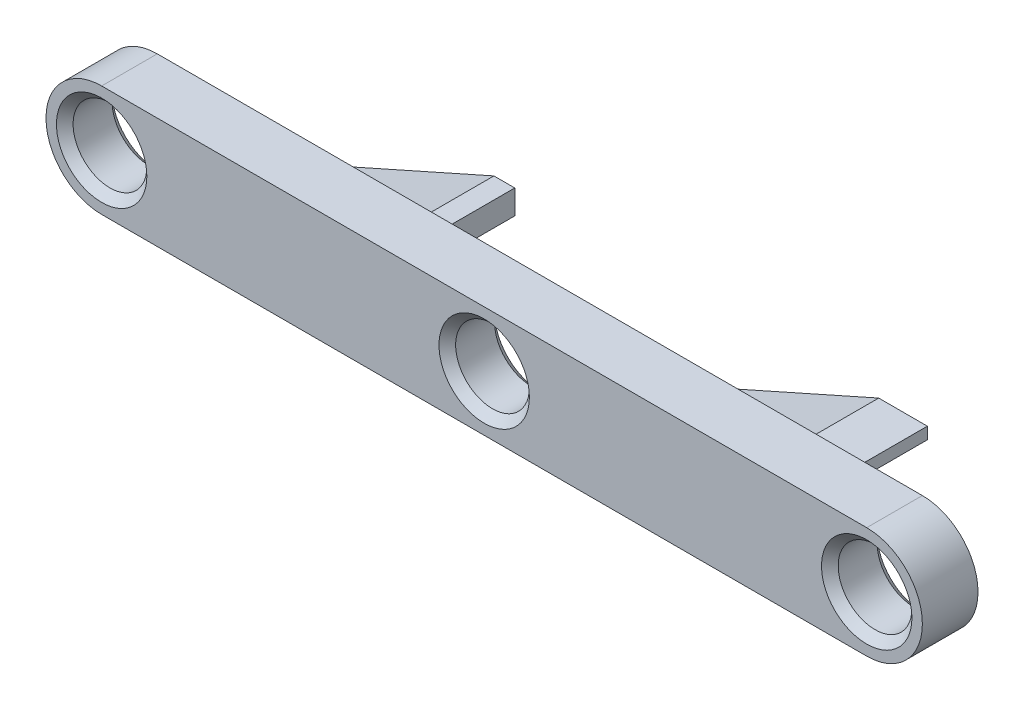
ISO-10303-21;
HEADER;
FILE_DESCRIPTION(('STEP AP214'),'2;1');
FILE_NAME('part.step','',(''),(''),'','','');
FILE_SCHEMA(('AUTOMOTIVE_DESIGN { 1 0 10303 214 1 1 1 1 }'));
ENDSEC;
DATA;
#1=APPLICATION_CONTEXT('core data for automotive mechanical design processes');
#2=APPLICATION_PROTOCOL_DEFINITION('international standard','automotive_design',2000,#1);
#3=PRODUCT_CONTEXT('',#1,'mechanical');
#4=PRODUCT('Part','Part','',(#3));
#5=PRODUCT_RELATED_PRODUCT_CATEGORY('part','',(#4));
#6=PRODUCT_DEFINITION_FORMATION('','',#4);
#7=PRODUCT_DEFINITION_CONTEXT('part definition',#1,'design');
#8=PRODUCT_DEFINITION('design','',#6,#7);
#9=PRODUCT_DEFINITION_SHAPE('','',#8);
#10=(LENGTH_UNIT() NAMED_UNIT(*) SI_UNIT(.MILLI.,.METRE.));
#11=(NAMED_UNIT(*) PLANE_ANGLE_UNIT() SI_UNIT($,.RADIAN.));
#12=(NAMED_UNIT(*) SI_UNIT($,.STERADIAN.) SOLID_ANGLE_UNIT());
#13=UNCERTAINTY_MEASURE_WITH_UNIT(LENGTH_MEASURE(1.E-05),#10,'distance_accuracy_value','');
#14=(GEOMETRIC_REPRESENTATION_CONTEXT(3) GLOBAL_UNCERTAINTY_ASSIGNED_CONTEXT((#13)) GLOBAL_UNIT_ASSIGNED_CONTEXT((#10,
#11,#12)) REPRESENTATION_CONTEXT('',''));
#15=CARTESIAN_POINT('',(0.,0.,0.));
#16=DIRECTION('',(0.,0.,1.));
#17=DIRECTION('',(1.,0.,0.));
#18=AXIS2_PLACEMENT_3D('',#15,#16,#17);
#19=CARTESIAN_POINT('',(-27.5,0.,0.));
#20=DIRECTION('',(0.,0.,1.));
#21=DIRECTION('',(1.,0.,0.));
#22=AXIS2_PLACEMENT_3D('',#19,#20,#21);
#23=PLANE('',#22);
#24=CARTESIAN_POINT('',(27.5,0.,0.));
#25=DIRECTION('',(0.,0.,1.));
#26=DIRECTION('',(1.,0.,0.));
#27=AXIS2_PLACEMENT_3D('',#24,#25,#26);
#28=CIRCLE('',#27,4.00000000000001);
#29=CARTESIAN_POINT('',(27.5,-4.00000000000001,0.));
#30=VERTEX_POINT('',#29);
#31=CARTESIAN_POINT('',(27.5,4.00000000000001,0.));
#32=VERTEX_POINT('',#31);
#33=EDGE_CURVE('E252',#30,#32,#28,.T.);
#34=ORIENTED_EDGE('',*,*,#33,.F.);
#35=DIRECTION('',(1.,0.,0.));
#36=VECTOR('',#35,1.);
#37=CARTESIAN_POINT('',(-27.5,-4.,0.));
#38=LINE('',#37,#36);
#39=CARTESIAN_POINT('',(-27.5,-4.,0.));
#40=VERTEX_POINT('',#39);
#41=EDGE_CURVE('E250',#40,#30,#38,.T.);
#42=ORIENTED_EDGE('',*,*,#41,.F.);
#43=CARTESIAN_POINT('',(-27.5,0.,0.));
#44=DIRECTION('',(0.,0.,1.));
#45=DIRECTION('',(1.,0.,0.));
#46=AXIS2_PLACEMENT_3D('',#43,#44,#45);
#47=CIRCLE('',#46,4.);
#48=CARTESIAN_POINT('',(-27.5,4.,0.));
#49=VERTEX_POINT('',#48);
#50=EDGE_CURVE('E236',#49,#40,#47,.T.);
#51=ORIENTED_EDGE('',*,*,#50,.F.);
#52=DIRECTION('',(-1.,0.,0.));
#53=VECTOR('',#52,1.);
#54=CARTESIAN_POINT('',(-27.5,4.,0.));
#55=LINE('',#54,#53);
#56=EDGE_CURVE('E241',#32,#49,#55,.T.);
#57=ORIENTED_EDGE('',*,*,#56,.F.);
#58=EDGE_LOOP('',(#34,#42,#51,#57));
#59=FACE_BOUND('',#58,.T.);
#60=DIRECTION('',(-1.,0.,0.));
#61=VECTOR('',#60,1.);
#62=CARTESIAN_POINT('',(8.,-3.8,0.));
#63=LINE('',#62,#61);
#64=CARTESIAN_POINT('',(8.,-3.8,0.));
#65=VERTEX_POINT('',#64);
#66=CARTESIAN_POINT('',(6.5,-3.8,0.));
#67=VERTEX_POINT('',#66);
#68=EDGE_CURVE('E212',#65,#67,#63,.T.);
#69=ORIENTED_EDGE('',*,*,#68,.F.);
#70=DIRECTION('',(-0.913545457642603,-0.406736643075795,0.));
#71=VECTOR('',#70,1.);
#72=CARTESIAN_POINT('',(23.160974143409,2.95010058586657,0.));
#73=LINE('',#72,#71);
#74=CARTESIAN_POINT('',(23.1609741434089,2.95010058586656,0.));
#75=VERTEX_POINT('',#74);
#76=EDGE_CURVE('E210',#75,#65,#73,.T.);
#77=ORIENTED_EDGE('',*,*,#76,.F.);
#78=DIRECTION('',(0.,-1.,0.));
#79=VECTOR('',#78,1.);
#80=CARTESIAN_POINT('',(23.160974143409,3.80000000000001,0.));
#81=LINE('',#80,#79);
#82=CARTESIAN_POINT('',(23.1609741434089,3.80000000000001,0.));
#83=VERTEX_POINT('',#82);
#84=EDGE_CURVE('E187',#83,#75,#81,.T.);
#85=ORIENTED_EDGE('',*,*,#84,.F.);
#86=DIRECTION('',(1.,0.,0.));
#87=VECTOR('',#86,1.);
#88=CARTESIAN_POINT('',(19.660974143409,3.80000000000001,0.));
#89=LINE('',#88,#87);
#90=CARTESIAN_POINT('',(19.660974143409,3.80000000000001,0.));
#91=VERTEX_POINT('',#90);
#92=EDGE_CURVE('E184',#91,#83,#89,.T.);
#93=ORIENTED_EDGE('',*,*,#92,.F.);
#94=DIRECTION('',(0.913545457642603,0.406736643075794,0.));
#95=VECTOR('',#94,1.);
#96=CARTESIAN_POINT('',(6.5,-2.0596432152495,0.));
#97=LINE('',#96,#95);
#98=CARTESIAN_POINT('',(6.5,-2.0596432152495,0.));
#99=VERTEX_POINT('',#98);
#100=EDGE_CURVE('E197',#99,#91,#97,.T.);
#101=ORIENTED_EDGE('',*,*,#100,.F.);
#102=DIRECTION('',(0.,1.,0.));
#103=VECTOR('',#102,1.);
#104=CARTESIAN_POINT('',(6.5,-3.8,0.));
#105=LINE('',#104,#103);
#106=EDGE_CURVE('E215',#67,#99,#105,.T.);
#107=ORIENTED_EDGE('',*,*,#106,.F.);
#108=EDGE_LOOP('',(#69,#77,#85,#93,#101,#107));
#109=FACE_BOUND('',#108,.T.);
#110=DIRECTION('',(0.913545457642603,0.406736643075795,0.));
#111=VECTOR('',#110,1.);
#112=CARTESIAN_POINT('',(-23.160974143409,-2.95010058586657,0.));
#113=LINE('',#112,#111);
#114=CARTESIAN_POINT('',(-23.160974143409,-2.95010058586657,0.));
#115=VERTEX_POINT('',#114);
#116=CARTESIAN_POINT('',(-8.,3.8,0.));
#117=VERTEX_POINT('',#116);
#118=EDGE_CURVE('E60',#115,#117,#113,.T.);
#119=ORIENTED_EDGE('',*,*,#118,.F.);
#120=DIRECTION('',(0.,1.,0.));
#121=VECTOR('',#120,1.);
#122=CARTESIAN_POINT('',(-23.160974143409,-3.80000000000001,0.));
#123=LINE('',#122,#121);
#124=CARTESIAN_POINT('',(-23.160974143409,-3.80000000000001,0.));
#125=VERTEX_POINT('',#124);
#126=EDGE_CURVE('E449',#125,#115,#123,.T.);
#127=ORIENTED_EDGE('',*,*,#126,.F.);
#128=DIRECTION('',(-1.,0.,0.));
#129=VECTOR('',#128,1.);
#130=CARTESIAN_POINT('',(-19.660974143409,-3.80000000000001,0.));
#131=LINE('',#130,#129);
#132=CARTESIAN_POINT('',(-19.660974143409,-3.80000000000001,0.));
#133=VERTEX_POINT('',#132);
#134=EDGE_CURVE('E183',#133,#125,#131,.T.);
#135=ORIENTED_EDGE('',*,*,#134,.F.);
#136=DIRECTION('',(-0.913545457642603,-0.406736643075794,0.));
#137=VECTOR('',#136,1.);
#138=CARTESIAN_POINT('',(-6.5,2.0596432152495,0.));
#139=LINE('',#138,#137);
#140=CARTESIAN_POINT('',(-6.5,2.0596432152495,0.));
#141=VERTEX_POINT('',#140);
#142=EDGE_CURVE('E179',#141,#133,#139,.T.);
#143=ORIENTED_EDGE('',*,*,#142,.F.);
#144=DIRECTION('',(0.,-1.,0.));
#145=VECTOR('',#144,1.);
#146=CARTESIAN_POINT('',(-6.5,3.8,0.));
#147=LINE('',#146,#145);
#148=CARTESIAN_POINT('',(-6.5,3.8,0.));
#149=VERTEX_POINT('',#148);
#150=EDGE_CURVE('E67',#149,#141,#147,.T.);
#151=ORIENTED_EDGE('',*,*,#150,.F.);
#152=DIRECTION('',(1.,0.,0.));
#153=VECTOR('',#152,1.);
#154=CARTESIAN_POINT('',(-8.,3.8,0.));
#155=LINE('',#154,#153);
#156=EDGE_CURVE('E462',#117,#149,#155,.T.);
#157=ORIENTED_EDGE('',*,*,#156,.F.);
#158=EDGE_LOOP('',(#119,#127,#135,#143,#151,#157));
#159=FACE_BOUND('',#158,.T.);
#160=CARTESIAN_POINT('',(27.5,0.,0.));
#161=DIRECTION('',(0.,0.,1.));
#162=DIRECTION('',(1.,0.,0.));
#163=AXIS2_PLACEMENT_3D('',#160,#161,#162);
#164=CIRCLE('',#163,3.24999999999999);
#165=CARTESIAN_POINT('',(30.75,0.,0.));
#166=VERTEX_POINT('',#165);
#167=EDGE_CURVE('E290',#166,#166,#164,.T.);
#168=ORIENTED_EDGE('',*,*,#167,.T.);
#169=EDGE_LOOP('',(#168));
#170=FACE_BOUND('',#169,.T.);
#171=CARTESIAN_POINT('',(0.,0.,0.));
#172=DIRECTION('',(0.,0.,1.));
#173=DIRECTION('',(1.,0.,0.));
#174=AXIS2_PLACEMENT_3D('',#171,#172,#173);
#175=CIRCLE('',#174,3.25);
#176=CARTESIAN_POINT('',(3.25,0.,0.));
#177=VERTEX_POINT('',#176);
#178=EDGE_CURVE('E278',#177,#177,#175,.T.);
#179=ORIENTED_EDGE('',*,*,#178,.T.);
#180=EDGE_LOOP('',(#179));
#181=FACE_BOUND('',#180,.T.);
#182=CARTESIAN_POINT('',(-27.5,0.,0.));
#183=DIRECTION('',(0.,0.,1.));
#184=DIRECTION('',(1.,0.,0.));
#185=AXIS2_PLACEMENT_3D('',#182,#183,#184);
#186=CIRCLE('',#185,3.25);
#187=CARTESIAN_POINT('',(-24.25,0.,0.));
#188=VERTEX_POINT('',#187);
#189=EDGE_CURVE('E272',#188,#188,#186,.T.);
#190=ORIENTED_EDGE('',*,*,#189,.T.);
#191=EDGE_LOOP('',(#190));
#192=FACE_BOUND('',#191,.T.);
#193=ADVANCED_FACE('F44',(#59,#109,#159,#170,#181,#192),#23,.F.);
#194=CARTESIAN_POINT('',(-27.5,0.,4.));
#195=DIRECTION('',(0.,0.,-1.));
#196=DIRECTION('',(-1.,0.,0.));
#197=AXIS2_PLACEMENT_3D('',#194,#195,#196);
#198=CYLINDRICAL_SURFACE('',#197,4.);
#199=ORIENTED_EDGE('',*,*,#50,.T.);
#200=DIRECTION('',(0.,0.,-1.));
#201=VECTOR('',#200,1.);
#202=CARTESIAN_POINT('',(-27.5,-4.,4.));
#203=LINE('',#202,#201);
#204=CARTESIAN_POINT('',(-27.5,-4.,4.));
#205=VERTEX_POINT('',#204);
#206=EDGE_CURVE('E263',#205,#40,#203,.T.);
#207=ORIENTED_EDGE('',*,*,#206,.F.);
#208=CARTESIAN_POINT('',(-27.5,0.,4.));
#209=DIRECTION('',(0.,0.,1.));
#210=DIRECTION('',(1.,0.,0.));
#211=AXIS2_PLACEMENT_3D('',#208,#209,#210);
#212=CIRCLE('',#211,4.);
#213=CARTESIAN_POINT('',(-27.5,4.,4.));
#214=VERTEX_POINT('',#213);
#215=EDGE_CURVE('E237',#214,#205,#212,.T.);
#216=ORIENTED_EDGE('',*,*,#215,.F.);
#217=DIRECTION('',(0.,0.,-1.));
#218=VECTOR('',#217,1.);
#219=CARTESIAN_POINT('',(-27.5,4.,4.));
#220=LINE('',#219,#218);
#221=EDGE_CURVE('E247',#214,#49,#220,.T.);
#222=ORIENTED_EDGE('',*,*,#221,.T.);
#223=EDGE_LOOP('',(#199,#207,#216,#222));
#224=FACE_BOUND('',#223,.T.);
#225=ADVANCED_FACE('F317',(#224),#198,.T.);
#226=CARTESIAN_POINT('',(-27.5,-4.,4.));
#227=DIRECTION('',(0.,1.,0.));
#228=DIRECTION('',(0.,0.,1.));
#229=AXIS2_PLACEMENT_3D('',#226,#227,#228);
#230=PLANE('',#229);
#231=ORIENTED_EDGE('',*,*,#41,.T.);
#232=DIRECTION('',(0.,0.,-1.));
#233=VECTOR('',#232,1.);
#234=CARTESIAN_POINT('',(27.5,-4.00000000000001,4.));
#235=LINE('',#234,#233);
#236=CARTESIAN_POINT('',(27.5,-4.00000000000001,4.));
#237=VERTEX_POINT('',#236);
#238=EDGE_CURVE('E260',#237,#30,#235,.T.);
#239=ORIENTED_EDGE('',*,*,#238,.F.);
#240=DIRECTION('',(1.,0.,0.));
#241=VECTOR('',#240,1.);
#242=CARTESIAN_POINT('',(-27.5,-4.,4.));
#243=LINE('',#242,#241);
#244=EDGE_CURVE('E240',#205,#237,#243,.T.);
#245=ORIENTED_EDGE('',*,*,#244,.F.);
#246=ORIENTED_EDGE('',*,*,#206,.T.);
#247=EDGE_LOOP('',(#231,#239,#245,#246));
#248=FACE_BOUND('',#247,.T.);
#249=ADVANCED_FACE('F325',(#248),#230,.F.);
#250=CARTESIAN_POINT('',(27.5,0.,4.));
#251=DIRECTION('',(0.,0.,-1.));
#252=DIRECTION('',(-1.,0.,0.));
#253=AXIS2_PLACEMENT_3D('',#250,#251,#252);
#254=CYLINDRICAL_SURFACE('',#253,4.00000000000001);
#255=ORIENTED_EDGE('',*,*,#33,.T.);
#256=DIRECTION('',(0.,0.,-1.));
#257=VECTOR('',#256,1.);
#258=CARTESIAN_POINT('',(27.5,4.00000000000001,4.));
#259=LINE('',#258,#257);
#260=CARTESIAN_POINT('',(27.5,4.00000000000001,4.));
#261=VERTEX_POINT('',#260);
#262=EDGE_CURVE('E257',#261,#32,#259,.T.);
#263=ORIENTED_EDGE('',*,*,#262,.F.);
#264=CARTESIAN_POINT('',(27.5,0.,4.));
#265=DIRECTION('',(0.,0.,1.));
#266=DIRECTION('',(1.,0.,0.));
#267=AXIS2_PLACEMENT_3D('',#264,#265,#266);
#268=CIRCLE('',#267,4.00000000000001);
#269=EDGE_CURVE('E243',#237,#261,#268,.T.);
#270=ORIENTED_EDGE('',*,*,#269,.F.);
#271=ORIENTED_EDGE('',*,*,#238,.T.);
#272=EDGE_LOOP('',(#255,#263,#270,#271));
#273=FACE_BOUND('',#272,.T.);
#274=ADVANCED_FACE('F337',(#273),#254,.T.);
#275=CARTESIAN_POINT('',(-27.5,4.,4.));
#276=DIRECTION('',(0.,-1.,0.));
#277=DIRECTION('',(1.,0.,0.));
#278=AXIS2_PLACEMENT_3D('',#275,#276,#277);
#279=PLANE('',#278);
#280=ORIENTED_EDGE('',*,*,#56,.T.);
#281=ORIENTED_EDGE('',*,*,#221,.F.);
#282=DIRECTION('',(-1.,0.,0.));
#283=VECTOR('',#282,1.);
#284=CARTESIAN_POINT('',(-27.5,4.,4.));
#285=LINE('',#284,#283);
#286=EDGE_CURVE('E245',#261,#214,#285,.T.);
#287=ORIENTED_EDGE('',*,*,#286,.F.);
#288=ORIENTED_EDGE('',*,*,#262,.T.);
#289=EDGE_LOOP('',(#280,#281,#287,#288));
#290=FACE_BOUND('',#289,.T.);
#291=ADVANCED_FACE('F334',(#290),#279,.F.);
#292=CARTESIAN_POINT('',(-27.5,0.,4.));
#293=DIRECTION('',(0.,0.,1.));
#294=DIRECTION('',(1.,0.,0.));
#295=AXIS2_PLACEMENT_3D('',#292,#293,#294);
#296=PLANE('',#295);
#297=CARTESIAN_POINT('',(27.5,0.,4.));
#298=DIRECTION('',(0.,0.,1.));
#299=DIRECTION('',(1.,0.,0.));
#300=AXIS2_PLACEMENT_3D('',#297,#298,#299);
#301=CIRCLE('',#300,3.24999999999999);
#302=CARTESIAN_POINT('',(30.75,0.,4.));
#303=VERTEX_POINT('',#302);
#304=EDGE_CURVE('E11',#303,#303,#301,.F.);
#305=ORIENTED_EDGE('',*,*,#304,.T.);
#306=EDGE_LOOP('',(#305));
#307=FACE_BOUND('',#306,.T.);
#308=CARTESIAN_POINT('',(0.,0.,4.));
#309=DIRECTION('',(0.,0.,1.));
#310=DIRECTION('',(1.,0.,0.));
#311=AXIS2_PLACEMENT_3D('',#308,#309,#310);
#312=CIRCLE('',#311,3.24999999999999);
#313=CARTESIAN_POINT('',(3.24999999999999,0.,4.));
#314=VERTEX_POINT('',#313);
#315=EDGE_CURVE('E287',#314,#314,#312,.F.);
#316=ORIENTED_EDGE('',*,*,#315,.T.);
#317=EDGE_LOOP('',(#316));
#318=FACE_BOUND('',#317,.T.);
#319=CARTESIAN_POINT('',(-27.5,0.,4.));
#320=DIRECTION('',(0.,0.,1.));
#321=DIRECTION('',(1.,0.,0.));
#322=AXIS2_PLACEMENT_3D('',#319,#320,#321);
#323=CIRCLE('',#322,3.24999999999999);
#324=CARTESIAN_POINT('',(-24.25,0.,4.));
#325=VERTEX_POINT('',#324);
#326=EDGE_CURVE('E269',#325,#325,#323,.F.);
#327=ORIENTED_EDGE('',*,*,#326,.T.);
#328=EDGE_LOOP('',(#327));
#329=FACE_BOUND('',#328,.T.);
#330=ORIENTED_EDGE('',*,*,#215,.T.);
#331=ORIENTED_EDGE('',*,*,#244,.T.);
#332=ORIENTED_EDGE('',*,*,#269,.T.);
#333=ORIENTED_EDGE('',*,*,#286,.T.);
#334=EDGE_LOOP('',(#330,#331,#332,#333));
#335=FACE_BOUND('',#334,.T.);
#336=ADVANCED_FACE('F332',(#307,#318,#329,#335),#296,.T.);
#337=CARTESIAN_POINT('',(27.5,0.,0.));
#338=DIRECTION('',(0.,0.,1.));
#339=DIRECTION('',(1.,0.,0.));
#340=AXIS2_PLACEMENT_3D('',#337,#338,#339);
#341=CYLINDRICAL_SURFACE('',#340,2.65);
#342=CARTESIAN_POINT('',(27.5,0.,3.4));
#343=DIRECTION('',(0.,0.,1.));
#344=DIRECTION('',(1.,0.,0.));
#345=AXIS2_PLACEMENT_3D('',#342,#343,#344);
#346=CIRCLE('',#345,2.65);
#347=CARTESIAN_POINT('',(30.15,0.,3.4));
#348=VERTEX_POINT('',#347);
#349=EDGE_CURVE('E53',#348,#348,#346,.T.);
#350=ORIENTED_EDGE('',*,*,#349,.T.);
#351=EDGE_LOOP('',(#350));
#352=FACE_BOUND('',#351,.T.);
#353=CARTESIAN_POINT('',(27.5,0.,0.599999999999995));
#354=DIRECTION('',(0.,0.,1.));
#355=DIRECTION('',(1.,0.,0.));
#356=AXIS2_PLACEMENT_3D('',#353,#354,#355);
#357=CIRCLE('',#356,2.65);
#358=CARTESIAN_POINT('',(30.15,0.,0.599999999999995));
#359=VERTEX_POINT('',#358);
#360=EDGE_CURVE('E293',#359,#359,#357,.F.);
#361=ORIENTED_EDGE('',*,*,#360,.T.);
#362=EDGE_LOOP('',(#361));
#363=FACE_BOUND('',#362,.T.);
#364=ADVANCED_FACE('F298',(#352,#363),#341,.F.);
#365=CARTESIAN_POINT('',(0.,0.,0.));
#366=DIRECTION('',(0.,0.,1.));
#367=DIRECTION('',(1.,0.,0.));
#368=AXIS2_PLACEMENT_3D('',#365,#366,#367);
#369=CYLINDRICAL_SURFACE('',#368,2.65);
#370=CARTESIAN_POINT('',(0.,0.,3.4));
#371=DIRECTION('',(0.,0.,1.));
#372=DIRECTION('',(1.,0.,0.));
#373=AXIS2_PLACEMENT_3D('',#370,#371,#372);
#374=CIRCLE('',#373,2.65);
#375=CARTESIAN_POINT('',(2.65,0.,3.4));
#376=VERTEX_POINT('',#375);
#377=EDGE_CURVE('E284',#376,#376,#374,.T.);
#378=ORIENTED_EDGE('',*,*,#377,.T.);
#379=EDGE_LOOP('',(#378));
#380=FACE_BOUND('',#379,.T.);
#381=CARTESIAN_POINT('',(0.,0.,0.6));
#382=DIRECTION('',(0.,0.,1.));
#383=DIRECTION('',(1.,0.,0.));
#384=AXIS2_PLACEMENT_3D('',#381,#382,#383);
#385=CIRCLE('',#384,2.65);
#386=CARTESIAN_POINT('',(2.65,0.,0.6));
#387=VERTEX_POINT('',#386);
#388=EDGE_CURVE('E281',#387,#387,#385,.F.);
#389=ORIENTED_EDGE('',*,*,#388,.T.);
#390=EDGE_LOOP('',(#389));
#391=FACE_BOUND('',#390,.T.);
#392=ADVANCED_FACE('F383',(#380,#391),#369,.F.);
#393=CARTESIAN_POINT('',(-27.5,0.,0.));
#394=DIRECTION('',(0.,0.,1.));
#395=DIRECTION('',(1.,0.,0.));
#396=AXIS2_PLACEMENT_3D('',#393,#394,#395);
#397=CYLINDRICAL_SURFACE('',#396,2.65);
#398=CARTESIAN_POINT('',(-27.5,0.,0.600000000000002));
#399=DIRECTION('',(0.,0.,1.));
#400=DIRECTION('',(1.,0.,0.));
#401=AXIS2_PLACEMENT_3D('',#398,#399,#400);
#402=CIRCLE('',#401,2.65);
#403=CARTESIAN_POINT('',(-24.85,0.,0.600000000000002));
#404=VERTEX_POINT('',#403);
#405=EDGE_CURVE('E275',#404,#404,#402,.F.);
#406=ORIENTED_EDGE('',*,*,#405,.T.);
#407=EDGE_LOOP('',(#406));
#408=FACE_BOUND('',#407,.T.);
#409=CARTESIAN_POINT('',(-27.5,0.,3.4));
#410=DIRECTION('',(0.,0.,1.));
#411=DIRECTION('',(1.,0.,0.));
#412=AXIS2_PLACEMENT_3D('',#409,#410,#411);
#413=CIRCLE('',#412,2.65);
#414=CARTESIAN_POINT('',(-24.85,0.,3.4));
#415=VERTEX_POINT('',#414);
#416=EDGE_CURVE('E266',#415,#415,#413,.T.);
#417=ORIENTED_EDGE('',*,*,#416,.T.);
#418=EDGE_LOOP('',(#417));
#419=FACE_BOUND('',#418,.T.);
#420=ADVANCED_FACE('F352',(#408,#419),#397,.F.);
#421=CARTESIAN_POINT('',(-27.5,0.,3.4));
#422=DIRECTION('',(0.,0.,1.));
#423=DIRECTION('',(1.,0.,0.));
#424=AXIS2_PLACEMENT_3D('',#421,#422,#423);
#425=CONICAL_SURFACE('',#424,2.65,0.785398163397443);
#426=ORIENTED_EDGE('',*,*,#326,.F.);
#427=EDGE_LOOP('',(#426));
#428=FACE_BOUND('',#427,.T.);
#429=ORIENTED_EDGE('',*,*,#416,.F.);
#430=EDGE_LOOP('',(#429));
#431=FACE_BOUND('',#430,.T.);
#432=ADVANCED_FACE('F345',(#428,#431),#425,.F.);
#433=CARTESIAN_POINT('',(-27.5,0.,0.));
#434=DIRECTION('',(0.,0.,-1.));
#435=DIRECTION('',(-1.,0.,0.));
#436=AXIS2_PLACEMENT_3D('',#433,#434,#435);
#437=CONICAL_SURFACE('',#436,3.25,0.785398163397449);
#438=ORIENTED_EDGE('',*,*,#405,.F.);
#439=EDGE_LOOP('',(#438));
#440=FACE_BOUND('',#439,.T.);
#441=ORIENTED_EDGE('',*,*,#189,.F.);
#442=EDGE_LOOP('',(#441));
#443=FACE_BOUND('',#442,.T.);
#444=ADVANCED_FACE('F351',(#440,#443),#437,.F.);
#445=CARTESIAN_POINT('',(0.,0.,0.));
#446=DIRECTION('',(0.,0.,-1.));
#447=DIRECTION('',(-1.,0.,0.));
#448=AXIS2_PLACEMENT_3D('',#445,#446,#447);
#449=CONICAL_SURFACE('',#448,3.25,0.785398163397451);
#450=ORIENTED_EDGE('',*,*,#388,.F.);
#451=EDGE_LOOP('',(#450));
#452=FACE_BOUND('',#451,.T.);
#453=ORIENTED_EDGE('',*,*,#178,.F.);
#454=EDGE_LOOP('',(#453));
#455=FACE_BOUND('',#454,.T.);
#456=ADVANCED_FACE('F359',(#452,#455),#449,.F.);
#457=CARTESIAN_POINT('',(0.,0.,3.4));
#458=DIRECTION('',(0.,0.,1.));
#459=DIRECTION('',(1.,0.,0.));
#460=AXIS2_PLACEMENT_3D('',#457,#458,#459);
#461=CONICAL_SURFACE('',#460,2.65,0.785398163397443);
#462=ORIENTED_EDGE('',*,*,#315,.F.);
#463=EDGE_LOOP('',(#462));
#464=FACE_BOUND('',#463,.T.);
#465=ORIENTED_EDGE('',*,*,#377,.F.);
#466=EDGE_LOOP('',(#465));
#467=FACE_BOUND('',#466,.T.);
#468=ADVANCED_FACE('F313',(#464,#467),#461,.F.);
#469=CARTESIAN_POINT('',(27.5,0.,0.));
#470=DIRECTION('',(0.,0.,-1.));
#471=DIRECTION('',(-1.,0.,0.));
#472=AXIS2_PLACEMENT_3D('',#469,#470,#471);
#473=CONICAL_SURFACE('',#472,3.24999999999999,0.785398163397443);
#474=ORIENTED_EDGE('',*,*,#360,.F.);
#475=EDGE_LOOP('',(#474));
#476=FACE_BOUND('',#475,.T.);
#477=ORIENTED_EDGE('',*,*,#167,.F.);
#478=EDGE_LOOP('',(#477));
#479=FACE_BOUND('',#478,.T.);
#480=ADVANCED_FACE('F303',(#476,#479),#473,.F.);
#481=CARTESIAN_POINT('',(27.5,0.,3.4));
#482=DIRECTION('',(0.,0.,1.));
#483=DIRECTION('',(1.,0.,0.));
#484=AXIS2_PLACEMENT_3D('',#481,#482,#483);
#485=CONICAL_SURFACE('',#484,2.65,0.785398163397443);
#486=ORIENTED_EDGE('',*,*,#304,.F.);
#487=EDGE_LOOP('',(#486));
#488=FACE_BOUND('',#487,.T.);
#489=ORIENTED_EDGE('',*,*,#349,.F.);
#490=EDGE_LOOP('',(#489));
#491=FACE_BOUND('',#490,.T.);
#492=ADVANCED_FACE('F47',(#488,#491),#485,.F.);
#493=CARTESIAN_POINT('',(19.660974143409,3.80000000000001,-4.7));
#494=DIRECTION('',(0.,-1.,0.));
#495=DIRECTION('',(1.,0.,0.));
#496=AXIS2_PLACEMENT_3D('',#493,#494,#495);
#497=PLANE('',#496);
#498=ORIENTED_EDGE('',*,*,#92,.T.);
#499=DIRECTION('',(0.,0.,1.));
#500=VECTOR('',#499,1.);
#501=CARTESIAN_POINT('',(23.160974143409,3.80000000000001,-4.7));
#502=LINE('',#501,#500);
#503=CARTESIAN_POINT('',(23.160974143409,3.80000000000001,-4.7));
#504=VERTEX_POINT('',#503);
#505=EDGE_CURVE('E233',#504,#83,#502,.T.);
#506=ORIENTED_EDGE('',*,*,#505,.F.);
#507=DIRECTION('',(1.,0.,0.));
#508=VECTOR('',#507,1.);
#509=CARTESIAN_POINT('',(19.660974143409,3.80000000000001,-4.7));
#510=LINE('',#509,#508);
#511=CARTESIAN_POINT('',(19.660974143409,3.80000000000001,-4.7));
#512=VERTEX_POINT('',#511);
#513=EDGE_CURVE('E193',#512,#504,#510,.T.);
#514=ORIENTED_EDGE('',*,*,#513,.F.);
#515=DIRECTION('',(0.,0.,1.));
#516=VECTOR('',#515,1.);
#517=CARTESIAN_POINT('',(19.660974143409,3.80000000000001,-4.7));
#518=LINE('',#517,#516);
#519=EDGE_CURVE('E206',#512,#91,#518,.T.);
#520=ORIENTED_EDGE('',*,*,#519,.T.);
#521=EDGE_LOOP('',(#498,#506,#514,#520));
#522=FACE_BOUND('',#521,.T.);
#523=ADVANCED_FACE('F302',(#522),#497,.F.);
#524=CARTESIAN_POINT('',(23.160974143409,3.80000000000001,-4.7));
#525=DIRECTION('',(-1.,0.,0.));
#526=DIRECTION('',(0.,0.,1.));
#527=AXIS2_PLACEMENT_3D('',#524,#525,#526);
#528=PLANE('',#527);
#529=ORIENTED_EDGE('',*,*,#84,.T.);
#530=DIRECTION('',(0.,0.,1.));
#531=VECTOR('',#530,1.);
#532=CARTESIAN_POINT('',(23.160974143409,2.95010058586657,-4.7));
#533=LINE('',#532,#531);
#534=CARTESIAN_POINT('',(23.160974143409,2.95010058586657,-4.7));
#535=VERTEX_POINT('',#534);
#536=EDGE_CURVE('E230',#535,#75,#533,.T.);
#537=ORIENTED_EDGE('',*,*,#536,.F.);
#538=DIRECTION('',(0.,-1.,0.));
#539=VECTOR('',#538,1.);
#540=CARTESIAN_POINT('',(23.160974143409,3.80000000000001,-4.7));
#541=LINE('',#540,#539);
#542=EDGE_CURVE('E196',#504,#535,#541,.T.);
#543=ORIENTED_EDGE('',*,*,#542,.F.);
#544=ORIENTED_EDGE('',*,*,#505,.T.);
#545=EDGE_LOOP('',(#529,#537,#543,#544));
#546=FACE_BOUND('',#545,.T.);
#547=ADVANCED_FACE('F309',(#546),#528,.F.);
#548=CARTESIAN_POINT('',(23.160974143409,2.95010058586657,-4.7));
#549=DIRECTION('',(-0.406736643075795,0.913545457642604,0.));
#550=DIRECTION('',(-0.913545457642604,-0.406736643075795,0.));
#551=AXIS2_PLACEMENT_3D('',#548,#549,#550);
#552=PLANE('',#551);
#553=ORIENTED_EDGE('',*,*,#76,.T.);
#554=DIRECTION('',(0.,0.,1.));
#555=VECTOR('',#554,1.);
#556=CARTESIAN_POINT('',(8.,-3.8,-4.7));
#557=LINE('',#556,#555);
#558=CARTESIAN_POINT('',(8.,-3.8,-4.7));
#559=VERTEX_POINT('',#558);
#560=EDGE_CURVE('E227',#559,#65,#557,.T.);
#561=ORIENTED_EDGE('',*,*,#560,.F.);
#562=DIRECTION('',(-0.913545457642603,-0.406736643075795,0.));
#563=VECTOR('',#562,1.);
#564=CARTESIAN_POINT('',(23.160974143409,2.95010058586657,-4.7));
#565=LINE('',#564,#563);
#566=EDGE_CURVE('E199',#535,#559,#565,.T.);
#567=ORIENTED_EDGE('',*,*,#566,.F.);
#568=ORIENTED_EDGE('',*,*,#536,.T.);
#569=EDGE_LOOP('',(#553,#561,#567,#568));
#570=FACE_BOUND('',#569,.T.);
#571=ADVANCED_FACE('F401',(#570),#552,.F.);
#572=CARTESIAN_POINT('',(8.,-3.8,-4.7));
#573=DIRECTION('',(0.,1.,0.));
#574=DIRECTION('',(0.,0.,1.));
#575=AXIS2_PLACEMENT_3D('',#572,#573,#574);
#576=PLANE('',#575);
#577=ORIENTED_EDGE('',*,*,#68,.T.);
#578=DIRECTION('',(0.,0.,1.));
#579=VECTOR('',#578,1.);
#580=CARTESIAN_POINT('',(6.5,-3.8,-4.7));
#581=LINE('',#580,#579);
#582=CARTESIAN_POINT('',(6.5,-3.8,-4.7));
#583=VERTEX_POINT('',#582);
#584=EDGE_CURVE('E224',#583,#67,#581,.T.);
#585=ORIENTED_EDGE('',*,*,#584,.F.);
#586=DIRECTION('',(-1.,0.,0.));
#587=VECTOR('',#586,1.);
#588=CARTESIAN_POINT('',(8.,-3.8,-4.7));
#589=LINE('',#588,#587);
#590=EDGE_CURVE('E201',#559,#583,#589,.T.);
#591=ORIENTED_EDGE('',*,*,#590,.F.);
#592=ORIENTED_EDGE('',*,*,#560,.T.);
#593=EDGE_LOOP('',(#577,#585,#591,#592));
#594=FACE_BOUND('',#593,.T.);
#595=ADVANCED_FACE('F405',(#594),#576,.F.);
#596=CARTESIAN_POINT('',(6.5,-3.8,-4.7));
#597=DIRECTION('',(1.,0.,0.));
#598=DIRECTION('',(0.,0.,-1.));
#599=AXIS2_PLACEMENT_3D('',#596,#597,#598);
#600=PLANE('',#599);
#601=ORIENTED_EDGE('',*,*,#106,.T.);
#602=DIRECTION('',(0.,0.,1.));
#603=VECTOR('',#602,1.);
#604=CARTESIAN_POINT('',(6.5,-2.0596432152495,-4.7));
#605=LINE('',#604,#603);
#606=CARTESIAN_POINT('',(6.5,-2.0596432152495,-4.7));
#607=VERTEX_POINT('',#606);
#608=EDGE_CURVE('E221',#607,#99,#605,.T.);
#609=ORIENTED_EDGE('',*,*,#608,.F.);
#610=DIRECTION('',(0.,1.,0.));
#611=VECTOR('',#610,1.);
#612=CARTESIAN_POINT('',(6.5,-3.8,-4.7));
#613=LINE('',#612,#611);
#614=EDGE_CURVE('E203',#583,#607,#613,.T.);
#615=ORIENTED_EDGE('',*,*,#614,.F.);
#616=ORIENTED_EDGE('',*,*,#584,.T.);
#617=EDGE_LOOP('',(#601,#609,#615,#616));
#618=FACE_BOUND('',#617,.T.);
#619=ADVANCED_FACE('F409',(#618),#600,.F.);
#620=CARTESIAN_POINT('',(6.5,-2.0596432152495,-4.7));
#621=DIRECTION('',(0.406736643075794,-0.913545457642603,0.));
#622=DIRECTION('',(0.913545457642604,0.406736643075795,0.));
#623=AXIS2_PLACEMENT_3D('',#620,#621,#622);
#624=PLANE('',#623);
#625=ORIENTED_EDGE('',*,*,#519,.F.);
#626=DIRECTION('',(0.913545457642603,0.406736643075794,0.));
#627=VECTOR('',#626,1.);
#628=CARTESIAN_POINT('',(6.5,-2.0596432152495,-4.7));
#629=LINE('',#628,#627);
#630=EDGE_CURVE('E205',#607,#512,#629,.T.);
#631=ORIENTED_EDGE('',*,*,#630,.F.);
#632=ORIENTED_EDGE('',*,*,#608,.T.);
#633=ORIENTED_EDGE('',*,*,#100,.T.);
#634=EDGE_LOOP('',(#625,#631,#632,#633));
#635=FACE_BOUND('',#634,.T.);
#636=ADVANCED_FACE('F413',(#635),#624,.F.);
#637=CARTESIAN_POINT('',(0.,0.,-4.7));
#638=DIRECTION('',(0.,0.,-1.));
#639=DIRECTION('',(-1.,0.,0.));
#640=AXIS2_PLACEMENT_3D('',#637,#638,#639);
#641=PLANE('',#640);
#642=ORIENTED_EDGE('',*,*,#566,.T.);
#643=ORIENTED_EDGE('',*,*,#590,.T.);
#644=ORIENTED_EDGE('',*,*,#614,.T.);
#645=ORIENTED_EDGE('',*,*,#630,.T.);
#646=ORIENTED_EDGE('',*,*,#513,.T.);
#647=ORIENTED_EDGE('',*,*,#542,.T.);
#648=EDGE_LOOP('',(#642,#643,#644,#645,#646,#647));
#649=FACE_BOUND('',#648,.T.);
#650=ADVANCED_FACE('F417',(#649),#641,.T.);
#651=CARTESIAN_POINT('',(0.,0.,-4.7));
#652=DIRECTION('',(0.,0.,-1.));
#653=DIRECTION('',(1.,0.,0.));
#654=AXIS2_PLACEMENT_3D('',#651,#652,#653);
#655=PLANE('',#654);
#656=DIRECTION('',(-0.913545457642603,-0.406736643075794,0.));
#657=VECTOR('',#656,1.);
#658=CARTESIAN_POINT('',(-6.5,2.0596432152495,-4.7));
#659=LINE('',#658,#657);
#660=CARTESIAN_POINT('',(-6.5,2.0596432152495,-4.7));
#661=VERTEX_POINT('',#660);
#662=CARTESIAN_POINT('',(-19.660974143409,-3.80000000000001,-4.7));
#663=VERTEX_POINT('',#662);
#664=EDGE_CURVE('E175',#661,#663,#659,.T.);
#665=ORIENTED_EDGE('',*,*,#664,.T.);
#666=DIRECTION('',(-1.,0.,0.));
#667=VECTOR('',#666,1.);
#668=CARTESIAN_POINT('',(-19.660974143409,-3.80000000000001,-4.7));
#669=LINE('',#668,#667);
#670=CARTESIAN_POINT('',(-23.160974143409,-3.80000000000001,-4.7));
#671=VERTEX_POINT('',#670);
#672=EDGE_CURVE('E170',#663,#671,#669,.T.);
#673=ORIENTED_EDGE('',*,*,#672,.T.);
#674=DIRECTION('',(0.,1.,0.));
#675=VECTOR('',#674,1.);
#676=CARTESIAN_POINT('',(-23.160974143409,-3.80000000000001,-4.7));
#677=LINE('',#676,#675);
#678=CARTESIAN_POINT('',(-23.160974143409,-2.95010058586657,-4.7));
#679=VERTEX_POINT('',#678);
#680=EDGE_CURVE('E160',#671,#679,#677,.T.);
#681=ORIENTED_EDGE('',*,*,#680,.T.);
#682=DIRECTION('',(0.913545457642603,0.406736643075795,0.));
#683=VECTOR('',#682,1.);
#684=CARTESIAN_POINT('',(-23.160974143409,-2.95010058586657,-4.7));
#685=LINE('',#684,#683);
#686=CARTESIAN_POINT('',(-8.,3.8,-4.7));
#687=VERTEX_POINT('',#686);
#688=EDGE_CURVE('E169',#679,#687,#685,.T.);
#689=ORIENTED_EDGE('',*,*,#688,.T.);
#690=DIRECTION('',(1.,0.,0.));
#691=VECTOR('',#690,1.);
#692=CARTESIAN_POINT('',(-8.,3.8,-4.7));
#693=LINE('',#692,#691);
#694=CARTESIAN_POINT('',(-6.5,3.8,-4.7));
#695=VERTEX_POINT('',#694);
#696=EDGE_CURVE('E463',#687,#695,#693,.T.);
#697=ORIENTED_EDGE('',*,*,#696,.T.);
#698=DIRECTION('',(0.,-1.,0.));
#699=VECTOR('',#698,1.);
#700=CARTESIAN_POINT('',(-6.5,3.8,-4.7));
#701=LINE('',#700,#699);
#702=EDGE_CURVE('E454',#695,#661,#701,.T.);
#703=ORIENTED_EDGE('',*,*,#702,.T.);
#704=EDGE_LOOP('',(#665,#673,#681,#689,#697,#703));
#705=FACE_BOUND('',#704,.T.);
#706=ADVANCED_FACE('F173',(#705),#655,.T.);
#707=CARTESIAN_POINT('',(-23.160974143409,-3.80000000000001,-4.7));
#708=DIRECTION('',(1.,0.,0.));
#709=DIRECTION('',(0.,0.,-1.));
#710=AXIS2_PLACEMENT_3D('',#707,#708,#709);
#711=PLANE('',#710);
#712=ORIENTED_EDGE('',*,*,#126,.T.);
#713=DIRECTION('',(0.,0.,1.));
#714=VECTOR('',#713,1.);
#715=CARTESIAN_POINT('',(-23.160974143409,-2.95010058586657,-4.7));
#716=LINE('',#715,#714);
#717=EDGE_CURVE('E167',#679,#115,#716,.T.);
#718=ORIENTED_EDGE('',*,*,#717,.F.);
#719=ORIENTED_EDGE('',*,*,#680,.F.);
#720=DIRECTION('',(0.,0.,1.));
#721=VECTOR('',#720,1.);
#722=CARTESIAN_POINT('',(-23.160974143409,-3.80000000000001,-4.7));
#723=LINE('',#722,#721);
#724=EDGE_CURVE('E165',#671,#125,#723,.T.);
#725=ORIENTED_EDGE('',*,*,#724,.T.);
#726=EDGE_LOOP('',(#712,#718,#719,#725));
#727=FACE_BOUND('',#726,.T.);
#728=ADVANCED_FACE('F163',(#727),#711,.F.);
#729=CARTESIAN_POINT('',(-19.660974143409,-3.80000000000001,-4.7));
#730=DIRECTION('',(0.,1.,0.));
#731=DIRECTION('',(-1.,0.,0.));
#732=AXIS2_PLACEMENT_3D('',#729,#730,#731);
#733=PLANE('',#732);
#734=ORIENTED_EDGE('',*,*,#134,.T.);
#735=ORIENTED_EDGE('',*,*,#724,.F.);
#736=ORIENTED_EDGE('',*,*,#672,.F.);
#737=DIRECTION('',(0.,0.,1.));
#738=VECTOR('',#737,1.);
#739=CARTESIAN_POINT('',(-19.660974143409,-3.80000000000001,-4.7));
#740=LINE('',#739,#738);
#741=EDGE_CURVE('E444',#663,#133,#740,.T.);
#742=ORIENTED_EDGE('',*,*,#741,.T.);
#743=EDGE_LOOP('',(#734,#735,#736,#742));
#744=FACE_BOUND('',#743,.T.);
#745=ADVANCED_FACE('F181',(#744),#733,.F.);
#746=CARTESIAN_POINT('',(-23.160974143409,-2.95010058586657,-4.7));
#747=DIRECTION('',(0.406736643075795,-0.913545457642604,0.));
#748=DIRECTION('',(0.913545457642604,0.406736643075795,0.));
#749=AXIS2_PLACEMENT_3D('',#746,#747,#748);
#750=PLANE('',#749);
#751=DIRECTION('',(0.,0.,1.));
#752=VECTOR('',#751,1.);
#753=CARTESIAN_POINT('',(-8.,3.8,-4.7));
#754=LINE('',#753,#752);
#755=EDGE_CURVE('E189',#687,#117,#754,.T.);
#756=ORIENTED_EDGE('',*,*,#755,.F.);
#757=ORIENTED_EDGE('',*,*,#688,.F.);
#758=ORIENTED_EDGE('',*,*,#717,.T.);
#759=ORIENTED_EDGE('',*,*,#118,.T.);
#760=EDGE_LOOP('',(#756,#757,#758,#759));
#761=FACE_BOUND('',#760,.T.);
#762=ADVANCED_FACE('F426',(#761),#750,.F.);
#763=CARTESIAN_POINT('',(-6.5,2.0596432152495,-4.7));
#764=DIRECTION('',(-0.406736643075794,0.913545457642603,0.));
#765=DIRECTION('',(-0.913545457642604,-0.406736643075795,0.));
#766=AXIS2_PLACEMENT_3D('',#763,#764,#765);
#767=PLANE('',#766);
#768=ORIENTED_EDGE('',*,*,#142,.T.);
#769=ORIENTED_EDGE('',*,*,#741,.F.);
#770=ORIENTED_EDGE('',*,*,#664,.F.);
#771=DIRECTION('',(0.,0.,1.));
#772=VECTOR('',#771,1.);
#773=CARTESIAN_POINT('',(-6.5,2.0596432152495,-4.7));
#774=LINE('',#773,#772);
#775=EDGE_CURVE('E446',#661,#141,#774,.T.);
#776=ORIENTED_EDGE('',*,*,#775,.T.);
#777=EDGE_LOOP('',(#768,#769,#770,#776));
#778=FACE_BOUND('',#777,.T.);
#779=ADVANCED_FACE('F431',(#778),#767,.F.);
#780=CARTESIAN_POINT('',(-8.,3.8,-4.7));
#781=DIRECTION('',(0.,-1.,0.));
#782=DIRECTION('',(0.,0.,-1.));
#783=AXIS2_PLACEMENT_3D('',#780,#781,#782);
#784=PLANE('',#783);
#785=ORIENTED_EDGE('',*,*,#156,.T.);
#786=DIRECTION('',(0.,0.,1.));
#787=VECTOR('',#786,1.);
#788=CARTESIAN_POINT('',(-6.5,3.8,-4.7));
#789=LINE('',#788,#787);
#790=EDGE_CURVE('E452',#695,#149,#789,.T.);
#791=ORIENTED_EDGE('',*,*,#790,.F.);
#792=ORIENTED_EDGE('',*,*,#696,.F.);
#793=ORIENTED_EDGE('',*,*,#755,.T.);
#794=EDGE_LOOP('',(#785,#791,#792,#793));
#795=FACE_BOUND('',#794,.T.);
#796=ADVANCED_FACE('F432',(#795),#784,.F.);
#797=CARTESIAN_POINT('',(-6.5,3.8,-4.7));
#798=DIRECTION('',(-1.,0.,0.));
#799=DIRECTION('',(0.,0.,1.));
#800=AXIS2_PLACEMENT_3D('',#797,#798,#799);
#801=PLANE('',#800);
#802=ORIENTED_EDGE('',*,*,#150,.T.);
#803=ORIENTED_EDGE('',*,*,#775,.F.);
#804=ORIENTED_EDGE('',*,*,#702,.F.);
#805=ORIENTED_EDGE('',*,*,#790,.T.);
#806=EDGE_LOOP('',(#802,#803,#804,#805));
#807=FACE_BOUND('',#806,.T.);
#808=ADVANCED_FACE('F435',(#807),#801,.F.);
#809=CLOSED_SHELL('',(#193,#225,#249,#274,#291,#336,#364,#392,#420,#432,#444,#456,#468,#480,
#492,#523,#547,#571,#595,#619,#636,#650,#706,#728,#745,#762,#779,#796,#808));
#810=MANIFOLD_SOLID_BREP('B2',#809);
#811=ADVANCED_BREP_SHAPE_REPRESENTATION('',(#18,#810),#14);
#812=SHAPE_DEFINITION_REPRESENTATION(#9,#811);
ENDSEC;
END-ISO-10303-21;
